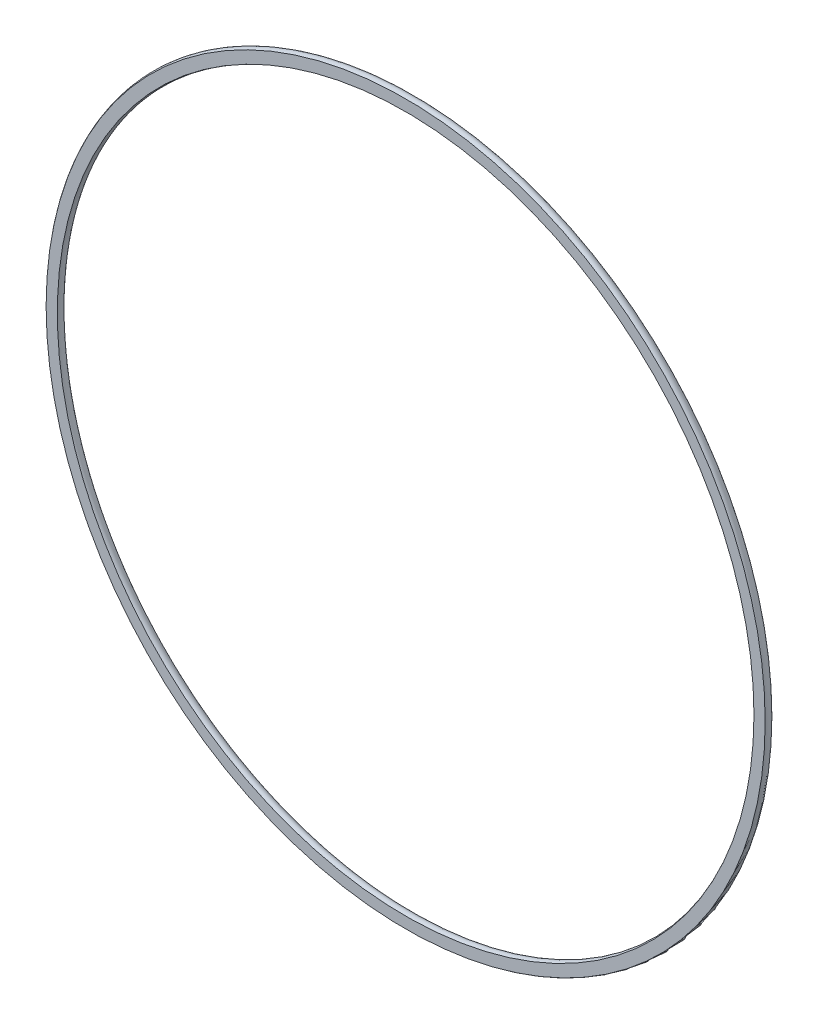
from build123d import *

# Parameters (mm, degrees)
SKETCH1_R          = 1.7653
SKETCH2_W          = 261.343302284
SKETCH2_H          = 236.0562857
CUT_EXTRUDE1_DEPTH = 0.889


with BuildPart() as part:
    # Sketch1 → Revolve1 (revolve)
    with BuildSketch(Plane(origin=(0, 0, 0), x_dir=(0, -1, 0), z_dir=(1, 0, 0)), mode=Mode.PRIVATE) as revolve1_sk:
        with Locations((96.8121, 0)):
            Circle(SKETCH1_R)
    revolve(revolve1_sk.sketch.rotate(Axis((0, 0, 1.7653), (0, 0, -1)), 270), axis=Axis((0, 0, 1.7653), (0, 0, -1)))

    # Sketch2 → Cut-Extrude1 (cut)
    with BuildSketch(Plane.XY.offset(1.7653)):
        with Locations((16.946272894, 3.773193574)):
            Rectangle(SKETCH2_W, SKETCH2_H)
    extrude(amount=-CUT_EXTRUDE1_DEPTH, mode=Mode.SUBTRACT)


solid = part.part
